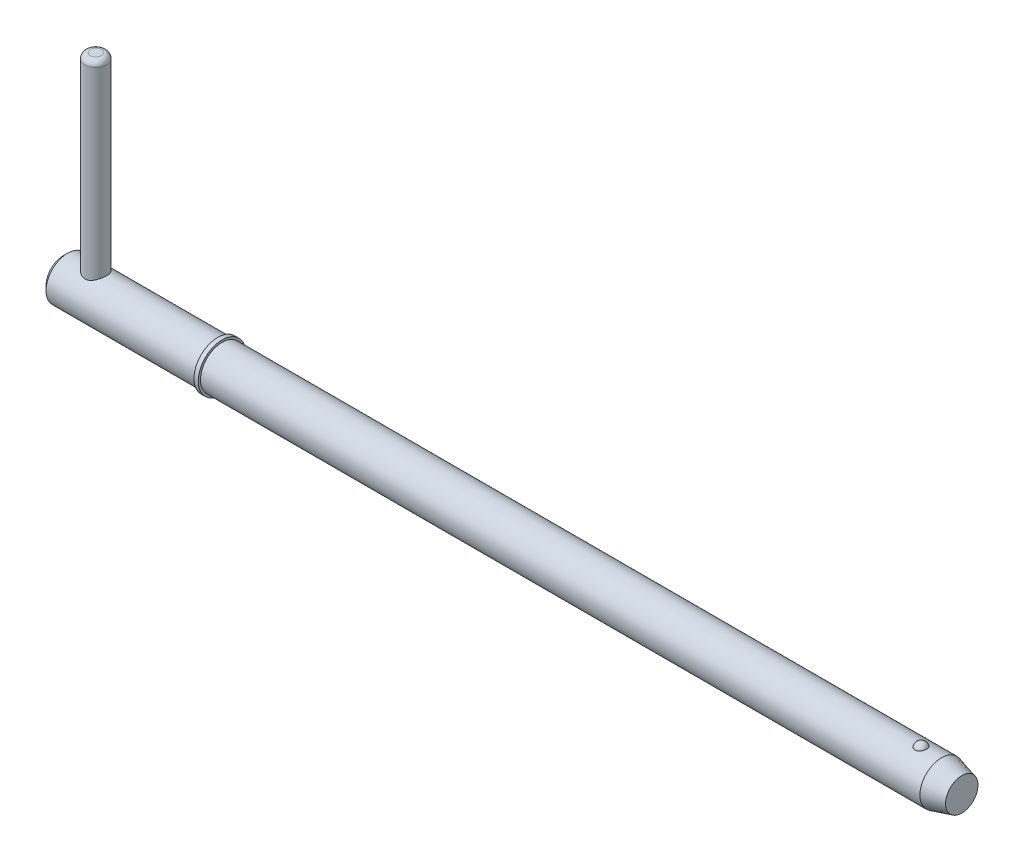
ISO-10303-21;
HEADER;
FILE_DESCRIPTION(('STEP AP214'),'2;1');
FILE_NAME('part.step','',(''),(''),'','','');
FILE_SCHEMA(('AUTOMOTIVE_DESIGN { 1 0 10303 214 1 1 1 1 }'));
ENDSEC;
DATA;
#1=APPLICATION_CONTEXT('core data for automotive mechanical design processes');
#2=APPLICATION_PROTOCOL_DEFINITION('international standard','automotive_design',2000,#1);
#3=PRODUCT_CONTEXT('',#1,'mechanical');
#4=PRODUCT('Part','Part','',(#3));
#5=PRODUCT_RELATED_PRODUCT_CATEGORY('part','',(#4));
#6=PRODUCT_DEFINITION_FORMATION('','',#4);
#7=PRODUCT_DEFINITION_CONTEXT('part definition',#1,'design');
#8=PRODUCT_DEFINITION('design','',#6,#7);
#9=PRODUCT_DEFINITION_SHAPE('','',#8);
#10=(LENGTH_UNIT() NAMED_UNIT(*) SI_UNIT(.MILLI.,.METRE.));
#11=(NAMED_UNIT(*) PLANE_ANGLE_UNIT() SI_UNIT($,.RADIAN.));
#12=(NAMED_UNIT(*) SI_UNIT($,.STERADIAN.) SOLID_ANGLE_UNIT());
#13=UNCERTAINTY_MEASURE_WITH_UNIT(LENGTH_MEASURE(1.E-05),#10,'distance_accuracy_value','');
#14=(GEOMETRIC_REPRESENTATION_CONTEXT(3) GLOBAL_UNCERTAINTY_ASSIGNED_CONTEXT((#13)) GLOBAL_UNIT_ASSIGNED_CONTEXT((#10,
#11,#12)) REPRESENTATION_CONTEXT('',''));
#15=CARTESIAN_POINT('',(0.,0.,0.));
#16=DIRECTION('',(0.,0.,1.));
#17=DIRECTION('',(1.,0.,0.));
#18=AXIS2_PLACEMENT_3D('',#15,#16,#17);
#19=CARTESIAN_POINT('',(3.57,23.02,0.));
#20=DIRECTION('',(0.,-1.,0.));
#21=DIRECTION('',(0.,0.,-1.));
#22=AXIS2_PLACEMENT_3D('',#19,#20,#21);
#23=CYLINDRICAL_SURFACE('',#22,1.19);
#24=CARTESIAN_POINT('',(3.57,-1.785,0.));
#25=DIRECTION('',(0.,1.,0.));
#26=DIRECTION('',(0.,0.,1.));
#27=AXIS2_PLACEMENT_3D('',#24,#25,#26);
#28=CIRCLE('',#27,1.19);
#29=CARTESIAN_POINT('',(3.57,-1.785,1.19));
#30=VERTEX_POINT('',#29);
#31=EDGE_CURVE('P0_E25',#30,#30,#28,.T.);
#32=ORIENTED_EDGE('',*,*,#31,.T.);
#33=EDGE_LOOP('',(#32));
#34=FACE_BOUND('',#33,.T.);
#35=CARTESIAN_POINT('',(3.57,22.425,0.));
#36=DIRECTION('',(0.,1.,0.));
#37=DIRECTION('',(0.,0.,1.));
#38=AXIS2_PLACEMENT_3D('',#35,#36,#37);
#39=CIRCLE('',#38,1.19);
#40=CARTESIAN_POINT('',(3.57,22.425,1.19));
#41=VERTEX_POINT('',#40);
#42=EDGE_CURVE('P0_E29',#41,#41,#39,.F.);
#43=ORIENTED_EDGE('',*,*,#42,.T.);
#44=EDGE_LOOP('',(#43));
#45=FACE_BOUND('',#44,.T.);
#46=ADVANCED_FACE('P0_F14',(#34,#45),#23,.T.);
#47=CARTESIAN_POINT('',(3.57,23.02,0.));
#48=DIRECTION('',(0.,1.,0.));
#49=DIRECTION('',(0.,0.,1.));
#50=AXIS2_PLACEMENT_3D('',#47,#48,#49);
#51=PLANE('',#50);
#52=CARTESIAN_POINT('',(3.57,23.02,0.));
#53=DIRECTION('',(0.,1.,0.));
#54=DIRECTION('',(0.,0.,1.));
#55=AXIS2_PLACEMENT_3D('',#52,#53,#54);
#56=CIRCLE('',#55,0.595);
#57=CARTESIAN_POINT('',(3.57,23.02,0.595));
#58=VERTEX_POINT('',#57);
#59=EDGE_CURVE('P0_E10',#58,#58,#56,.T.);
#60=ORIENTED_EDGE('',*,*,#59,.T.);
#61=EDGE_LOOP('',(#60));
#62=FACE_BOUND('',#61,.T.);
#63=ADVANCED_FACE('P0_F46',(#62),#51,.T.);
#64=CARTESIAN_POINT('',(3.57,-2.38,0.));
#65=DIRECTION('',(0.,1.,0.));
#66=DIRECTION('',(0.,0.,1.));
#67=AXIS2_PLACEMENT_3D('',#64,#65,#66);
#68=PLANE('',#67);
#69=CARTESIAN_POINT('',(3.57,-2.38,0.));
#70=DIRECTION('',(0.,1.,0.));
#71=DIRECTION('',(0.,0.,1.));
#72=AXIS2_PLACEMENT_3D('',#69,#70,#71);
#73=CIRCLE('',#72,0.595);
#74=CARTESIAN_POINT('',(3.57,-2.38,0.595));
#75=VERTEX_POINT('',#74);
#76=EDGE_CURVE('P0_E21',#75,#75,#73,.F.);
#77=ORIENTED_EDGE('',*,*,#76,.T.);
#78=EDGE_LOOP('',(#77));
#79=FACE_BOUND('',#78,.T.);
#80=ADVANCED_FACE('P0_F43',(#79),#68,.F.);
#81=CARTESIAN_POINT('',(3.57,-1.785,0.));
#82=DIRECTION('',(0.,1.,0.));
#83=DIRECTION('',(0.,0.,1.));
#84=AXIS2_PLACEMENT_3D('',#81,#82,#83);
#85=DEGENERATE_TOROIDAL_SURFACE('',#84,0.595,0.595,.T.);
#86=ORIENTED_EDGE('',*,*,#76,.F.);
#87=EDGE_LOOP('',(#86));
#88=FACE_BOUND('',#87,.T.);
#89=ORIENTED_EDGE('',*,*,#31,.F.);
#90=EDGE_LOOP('',(#89));
#91=FACE_BOUND('',#90,.T.);
#92=ADVANCED_FACE('P0_F38',(#88,#91),#85,.T.);
#93=CARTESIAN_POINT('',(3.57,22.425,0.));
#94=DIRECTION('',(0.,1.,0.));
#95=DIRECTION('',(0.,0.,1.));
#96=AXIS2_PLACEMENT_3D('',#93,#94,#95);
#97=DEGENERATE_TOROIDAL_SURFACE('',#96,0.595,0.595,.T.);
#98=ORIENTED_EDGE('',*,*,#42,.F.);
#99=EDGE_LOOP('',(#98));
#100=FACE_BOUND('',#99,.T.);
#101=ORIENTED_EDGE('',*,*,#59,.F.);
#102=EDGE_LOOP('',(#101));
#103=FACE_BOUND('',#102,.T.);
#104=ADVANCED_FACE('P0_F16',(#100,#103),#97,.T.);
#105=CLOSED_SHELL('',(#46,#63,#80,#92,#104));
#106=MANIFOLD_SOLID_BREP('P0_B1',#105);
#107=CARTESIAN_POINT('',(0.,0.,0.));
#108=DIRECTION('',(1.,0.,0.));
#109=DIRECTION('',(0.,0.,-1.));
#110=AXIS2_PLACEMENT_3D('',#107,#108,#109);
#111=CYLINDRICAL_SURFACE('',#110,2.38);
#112=CARTESIAN_POINT('',(96.5094297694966,0.,0.));
#113=DIRECTION('',(1.,0.,0.));
#114=DIRECTION('',(0.,0.,-1.));
#115=AXIS2_PLACEMENT_3D('',#112,#113,#114);
#116=CIRCLE('',#115,2.38);
#117=CARTESIAN_POINT('',(96.5094297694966,0.,-2.38));
#118=VERTEX_POINT('',#117);
#119=EDGE_CURVE('P1_E81',#118,#118,#116,.T.);
#120=ORIENTED_EDGE('',*,*,#119,.F.);
#121=EDGE_LOOP('',(#120));
#122=FACE_BOUND('',#121,.T.);
#123=CARTESIAN_POINT('',(17.45,0.,0.));
#124=DIRECTION('',(1.,0.,0.));
#125=DIRECTION('',(0.,0.,-1.));
#126=AXIS2_PLACEMENT_3D('',#123,#124,#125);
#127=CIRCLE('',#126,2.38);
#128=CARTESIAN_POINT('',(17.45,0.,-2.38));
#129=VERTEX_POINT('',#128);
#130=EDGE_CURVE('P1_E85',#129,#129,#127,.T.);
#131=ORIENTED_EDGE('',*,*,#130,.T.);
#132=EDGE_LOOP('',(#131));
#133=FACE_BOUND('',#132,.T.);
#134=CARTESIAN_POINT('',(94.2634492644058,2.2921568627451,0.640637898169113));
#135=CARTESIAN_POINT('',(94.2303559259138,2.29215737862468,0.64063719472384));
#136=CARTESIAN_POINT('',(94.1972546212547,2.29293179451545,0.637884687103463));
#137=CARTESIAN_POINT('',(94.1320176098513,2.29594030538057,0.626968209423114));
#138=CARTESIAN_POINT('',(94.0998823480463,2.29817506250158,0.618801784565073));
#139=CARTESIAN_POINT('',(94.0375402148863,2.3038430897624,0.597351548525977));
#140=CARTESIAN_POINT('',(94.0073305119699,2.30727454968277,0.584075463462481));
#141=CARTESIAN_POINT('',(93.9495674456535,2.31495941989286,0.552829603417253));
#142=CARTESIAN_POINT('',(93.9220141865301,2.31921286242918,0.534859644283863));
#143=CARTESIAN_POINT('',(93.8695938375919,2.32820213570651,0.494282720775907));
#144=CARTESIAN_POINT('',(93.8448050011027,2.33294694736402,0.471576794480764));
#145=CARTESIAN_POINT('',(93.7992169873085,2.34234144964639,0.422446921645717));
#146=CARTESIAN_POINT('',(93.7784185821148,2.34699112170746,0.396022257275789));
#147=CARTESIAN_POINT('',(93.7403580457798,2.35593942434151,0.338855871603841));
#148=CARTESIAN_POINT('',(93.7233051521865,2.36021170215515,0.307970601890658));
#149=CARTESIAN_POINT('',(93.6943607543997,2.3677057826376,0.243750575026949));
#150=CARTESIAN_POINT('',(93.6824701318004,2.37092740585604,0.210415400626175));
#151=CARTESIAN_POINT('',(93.6638076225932,2.37606901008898,0.141189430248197));
#152=CARTESIAN_POINT('',(93.6571956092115,2.37794816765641,0.105252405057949));
#153=CARTESIAN_POINT('',(93.6498095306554,2.38005135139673,0.032735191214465));
#154=CARTESIAN_POINT('',(93.6490358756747,2.38027526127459,-0.00384504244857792));
#155=CARTESIAN_POINT('',(93.6533628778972,2.37903842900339,-0.0769838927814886));
#156=CARTESIAN_POINT('',(93.6585202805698,2.37756141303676,-0.113538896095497));
#157=CARTESIAN_POINT('',(93.6747013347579,2.37305303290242,-0.185229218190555));
#158=CARTESIAN_POINT('',(93.6857251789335,2.37002161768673,-0.220364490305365));
#159=CARTESIAN_POINT('',(93.7133977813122,2.36273722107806,-0.288156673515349));
#160=CARTESIAN_POINT('',(93.7300389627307,2.35848588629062,-0.320816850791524));
#161=CARTESIAN_POINT('',(93.7685984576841,2.34923130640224,-0.382744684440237));
#162=CARTESIAN_POINT('',(93.790516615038,2.34422808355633,-0.412012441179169));
#163=CARTESIAN_POINT('',(93.8387549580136,2.33412555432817,-0.465830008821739));
#164=CARTESIAN_POINT('',(93.8650028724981,2.32902887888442,-0.490444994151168));
#165=CARTESIAN_POINT('',(93.9214769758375,2.31926941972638,-0.534700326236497));
#166=CARTESIAN_POINT('',(93.9517022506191,2.3146065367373,-0.554341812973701));
#167=CARTESIAN_POINT('',(94.0140618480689,2.30645675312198,-0.587312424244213));
#168=CARTESIAN_POINT('',(94.0460780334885,2.30293152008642,-0.600855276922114));
#169=CARTESIAN_POINT('',(94.1120795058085,2.29725171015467,-0.622220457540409));
#170=CARTESIAN_POINT('',(94.1460641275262,2.29509667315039,-0.630044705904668));
#171=CARTESIAN_POINT('',(94.213299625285,2.29249264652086,-0.639452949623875));
#172=CARTESIAN_POINT('',(94.2465087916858,2.29196755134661,-0.641315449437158));
#173=CARTESIAN_POINT('',(94.312763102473,2.29246849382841,-0.63952261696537));
#174=CARTESIAN_POINT('',(94.3458082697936,2.29349430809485,-0.635868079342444));
#175=CARTESIAN_POINT('',(94.4101025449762,2.29694059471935,-0.623301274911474));
#176=CARTESIAN_POINT('',(94.4413744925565,2.29933234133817,-0.614497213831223));
#177=CARTESIAN_POINT('',(94.5019952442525,2.30522511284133,-0.592006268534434));
#178=CARTESIAN_POINT('',(94.5313438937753,2.30872622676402,-0.578318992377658));
#179=CARTESIAN_POINT('',(94.5880369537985,2.31655795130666,-0.546112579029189));
#180=CARTESIAN_POINT('',(94.615320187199,2.32090569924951,-0.52749010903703));
#181=CARTESIAN_POINT('',(94.6664904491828,2.3299220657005,-0.486117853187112));
#182=CARTESIAN_POINT('',(94.6903767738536,2.33459075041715,-0.463367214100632));
#183=CARTESIAN_POINT('',(94.7352722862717,2.34399834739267,-0.41322006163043));
#184=CARTESIAN_POINT('',(94.7560972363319,2.34873051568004,-0.38565730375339));
#185=CARTESIAN_POINT('',(94.793056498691,2.35754932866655,-0.327455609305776));
#186=CARTESIAN_POINT('',(94.8091898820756,2.36163584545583,-0.296816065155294));
#187=CARTESIAN_POINT('',(94.8369822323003,2.36889321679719,-0.232047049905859));
#188=CARTESIAN_POINT('',(94.8484450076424,2.37202275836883,-0.197828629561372));
#189=CARTESIAN_POINT('',(94.8657523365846,2.37681926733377,-0.127900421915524));
#190=CARTESIAN_POINT('',(94.8715962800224,2.37848607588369,-0.092190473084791));
#191=CARTESIAN_POINT('',(94.877605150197,2.38020024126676,-0.0196348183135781));
#192=CARTESIAN_POINT('',(94.8776704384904,2.38021918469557,0.0172198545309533));
#193=CARTESIAN_POINT('',(94.8718689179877,2.37856356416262,0.0904219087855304));
#194=CARTESIAN_POINT('',(94.8660018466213,2.37688892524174,0.126769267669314));
#195=CARTESIAN_POINT('',(94.848425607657,2.37201688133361,0.198028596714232));
#196=CARTESIAN_POINT('',(94.8366998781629,2.36881516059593,0.232936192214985));
#197=CARTESIAN_POINT('',(94.8076354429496,2.36123444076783,0.300196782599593));
#198=CARTESIAN_POINT('',(94.7902967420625,2.3568554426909,0.332549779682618));
#199=CARTESIAN_POINT('',(94.7505350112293,2.34744667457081,0.39349541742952));
#200=CARTESIAN_POINT('',(94.7281528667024,2.34242227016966,0.422115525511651));
#201=CARTESIAN_POINT('',(94.6787391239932,2.33227293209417,0.475004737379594));
#202=CARTESIAN_POINT('',(94.6517076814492,2.32714800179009,0.499273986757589));
#203=CARTESIAN_POINT('',(94.5944988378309,2.31755359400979,0.542046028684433));
#204=CARTESIAN_POINT('',(94.5644297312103,2.3130698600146,0.560690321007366));
#205=CARTESIAN_POINT('',(94.5013869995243,2.30514125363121,0.592447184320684));
#206=CARTESIAN_POINT('',(94.4684158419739,2.30169550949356,0.605564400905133));
#207=CARTESIAN_POINT('',(94.4068424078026,2.29677744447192,0.623927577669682));
#208=CARTESIAN_POINT('',(94.3785555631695,2.295058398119,0.630178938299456));
#209=CARTESIAN_POINT('',(94.3213308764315,2.29274795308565,0.638534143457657));
#210=CARTESIAN_POINT('',(94.2923931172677,2.29215641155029,0.640638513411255));
#211=CARTESIAN_POINT('',(94.2634492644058,2.2921568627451,0.640637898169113));
#212=B_SPLINE_CURVE_WITH_KNOTS('',3,(#134,#135,#136,#137,#138,#139,#140,#141,#142,#143,#144,
#145,#146,#147,#148,#149,#150,#151,#152,#153,#154,#155,#156,#157,#158,#159,#160,#161,#162,#163,
#164,#165,#166,#167,#168,#169,#170,#171,#172,#173,#174,#175,#176,#177,#178,#179,#180,#181,#182,
#183,#184,#185,#186,#187,#188,#189,#190,#191,#192,#193,#194,#195,#196,#197,#198,#199,#200,#201,
#202,#203,#204,#205,#206,#207,#208,#209,#210,#211),.UNSPECIFIED.,.T.,.F.,(4,2,2,2,2,2,2,2,2,2,2,
2,2,2,2,2,2,2,2,2,2,2,2,2,2,2,2,2,2,2,2,2,2,2,2,2,2,2,4),(0.,0.0991724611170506,
0.198389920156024,0.297457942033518,0.396529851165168,0.497927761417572,0.59934527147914,
0.70547553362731,0.811623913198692,0.920876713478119,1.03013718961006,1.14045177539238,
1.25076998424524,1.36093998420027,1.47110672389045,1.57959248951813,1.68805336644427,
1.79234266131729,1.89659691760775,1.9959039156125,2.09519661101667,2.19247425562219,
2.2897597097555,2.38926978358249,2.48880044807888,2.59293588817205,2.69709193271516,
2.80525821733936,2.91343624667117,3.0234791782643,3.13352698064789,3.24388765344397,
3.35424823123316,3.46374443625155,3.5732369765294,3.67968690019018,3.78604717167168,
3.87279565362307,3.9595331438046),.UNSPECIFIED.);
#213=CARTESIAN_POINT('',(94.2634492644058,2.2921568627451,0.640637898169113));
#214=VERTEX_POINT('',#213);
#215=EDGE_CURVE('P1_E35',#214,#214,#212,.T.);
#216=ORIENTED_EDGE('',*,*,#215,.T.);
#217=EDGE_LOOP('',(#216));
#218=FACE_BOUND('',#217,.T.);
#219=ADVANCED_FACE('P1_F13',(#122,#133,#218),#111,.T.);
#220=CARTESIAN_POINT('',(0.,0.,0.));
#221=DIRECTION('',(-1.,0.,0.));
#222=DIRECTION('',(0.,0.,1.));
#223=AXIS2_PLACEMENT_3D('',#220,#221,#222);
#224=PLANE('',#223);
#225=CARTESIAN_POINT('',(0.,0.,0.));
#226=DIRECTION('',(1.,0.,0.));
#227=DIRECTION('',(0.,0.,-1.));
#228=AXIS2_PLACEMENT_3D('',#225,#226,#227);
#229=CIRCLE('',#228,1.904);
#230=CARTESIAN_POINT('',(0.,0.,-1.904));
#231=VERTEX_POINT('',#230);
#232=EDGE_CURVE('P1_E9',#231,#231,#229,.T.);
#233=ORIENTED_EDGE('',*,*,#232,.F.);
#234=EDGE_LOOP('',(#233));
#235=FACE_BOUND('',#234,.T.);
#236=ADVANCED_FACE('P1_F15',(#235),#224,.T.);
#237=CARTESIAN_POINT('',(0.475999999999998,0.,0.));
#238=DIRECTION('',(1.,0.,0.));
#239=DIRECTION('',(0.,0.,-1.));
#240=AXIS2_PLACEMENT_3D('',#237,#238,#239);
#241=CONICAL_SURFACE('',#240,2.38,0.78539816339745);
#242=ORIENTED_EDGE('',*,*,#232,.T.);
#243=EDGE_LOOP('',(#242));
#244=FACE_BOUND('',#243,.T.);
#245=CARTESIAN_POINT('',(0.475999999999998,0.,0.));
#246=DIRECTION('',(1.,0.,0.));
#247=DIRECTION('',(0.,0.,-1.));
#248=AXIS2_PLACEMENT_3D('',#245,#246,#247);
#249=CIRCLE('',#248,2.38);
#250=CARTESIAN_POINT('',(0.475999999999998,0.,-2.38));
#251=VERTEX_POINT('',#250);
#252=EDGE_CURVE('P1_E26',#251,#251,#249,.T.);
#253=ORIENTED_EDGE('',*,*,#252,.F.);
#254=EDGE_LOOP('',(#253));
#255=FACE_BOUND('',#254,.T.);
#256=ADVANCED_FACE('P1_F77',(#244,#255),#241,.T.);
#257=CARTESIAN_POINT('',(0.,0.,0.));
#258=DIRECTION('',(1.,0.,0.));
#259=DIRECTION('',(0.,0.,-1.));
#260=AXIS2_PLACEMENT_3D('',#257,#258,#259);
#261=CYLINDRICAL_SURFACE('',#260,2.38);
#262=CARTESIAN_POINT('',(3.57,-2.06114046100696,1.19));
#263=CARTESIAN_POINT('',(3.50799170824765,-2.06114586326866,1.18999567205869));
#264=CARTESIAN_POINT('',(3.4459051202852,-2.0639812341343,1.18512096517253));
#265=CARTESIAN_POINT('',(3.32363755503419,-2.07491216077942,1.16587061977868));
#266=CARTESIAN_POINT('',(3.26346086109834,-2.08301876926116,1.15147501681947));
#267=CARTESIAN_POINT('',(3.14701251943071,-2.10331722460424,1.11395893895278));
#268=CARTESIAN_POINT('',(3.09072196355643,-2.1154873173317,1.09088484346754));
#269=CARTESIAN_POINT('',(2.9828251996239,-2.14250771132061,1.03680835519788));
#270=CARTESIAN_POINT('',(2.93121924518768,-2.15735815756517,1.00580553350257));
#271=CARTESIAN_POINT('',(2.82945618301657,-2.18956274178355,0.933753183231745));
#272=CARTESIAN_POINT('',(2.77976962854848,-2.20702235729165,0.892085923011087));
#273=CARTESIAN_POINT('',(2.68772401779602,-2.2416265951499,0.801172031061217));
#274=CARTESIAN_POINT('',(2.64536861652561,-2.25877105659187,0.751921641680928));
#275=CARTESIAN_POINT('',(2.56639309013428,-2.29219557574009,0.64318258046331));
#276=CARTESIAN_POINT('',(2.53035201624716,-2.30833946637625,0.583227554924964));
#277=CARTESIAN_POINT('',(2.46908238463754,-2.3365739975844,0.45714686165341));
#278=CARTESIAN_POINT('',(2.44384700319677,-2.34866719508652,0.391025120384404));
#279=CARTESIAN_POINT('',(2.40676945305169,-2.36667748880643,0.259473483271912));
#280=CARTESIAN_POINT('',(2.39410206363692,-2.37297281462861,0.194329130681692));
#281=CARTESIAN_POINT('',(2.3798023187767,-2.3800902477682,0.0625590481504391));
#282=CARTESIAN_POINT('',(2.37816328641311,-2.38091566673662,-0.00406576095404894));
#283=CARTESIAN_POINT('',(2.38564854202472,-2.37717948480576,-0.130700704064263));
#284=CARTESIAN_POINT('',(2.39384923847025,-2.37308010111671,-0.190782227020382));
#285=CARTESIAN_POINT('',(2.41912820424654,-2.360653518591,-0.308583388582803));
#286=CARTESIAN_POINT('',(2.43620713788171,-2.35232600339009,-0.366302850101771));
#287=CARTESIAN_POINT('',(2.47886825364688,-2.33206184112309,-0.478748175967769));
#288=CARTESIAN_POINT('',(2.50456481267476,-2.32007685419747,-0.533421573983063));
#289=CARTESIAN_POINT('',(2.56357346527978,-2.29357798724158,-0.637812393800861));
#290=CARTESIAN_POINT('',(2.5968882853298,-2.27906320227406,-0.687528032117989));
#291=CARTESIAN_POINT('',(2.67380546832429,-2.24724829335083,-0.785606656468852));
#292=CARTESIAN_POINT('',(2.71808260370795,-2.22981457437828,-0.833397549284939));
#293=CARTESIAN_POINT('',(2.81386177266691,-2.19500665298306,-0.921184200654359));
#294=CARTESIAN_POINT('',(2.86536931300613,-2.17763250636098,-0.961173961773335));
#295=CARTESIAN_POINT('',(2.97815134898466,-2.14371545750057,-1.03471134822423));
#296=CARTESIAN_POINT('',(3.03983836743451,-2.12729540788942,-1.06768860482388));
#297=CARTESIAN_POINT('',(3.16889582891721,-2.09886785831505,-1.12254974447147));
#298=CARTESIAN_POINT('',(3.2362602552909,-2.0868557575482,-1.14444520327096));
#299=CARTESIAN_POINT('',(3.36914526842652,-2.06994116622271,-1.1747444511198));
#300=CARTESIAN_POINT('',(3.43438893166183,-2.06455070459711,-1.18407989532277));
#301=CARTESIAN_POINT('',(3.56571759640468,-2.06010324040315,-1.1918051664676));
#302=CARTESIAN_POINT('',(3.63180197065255,-2.06104176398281,-1.19020272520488));
#303=CARTESIAN_POINT('',(3.75522816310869,-2.06862860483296,-1.17695289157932));
#304=CARTESIAN_POINT('',(3.81273554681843,-2.07464109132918,-1.16642350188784));
#305=CARTESIAN_POINT('',(3.92505766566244,-2.09075885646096,-1.1372785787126));
#306=CARTESIAN_POINT('',(3.97987152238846,-2.1008654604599,-1.1186604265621));
#307=CARTESIAN_POINT('',(4.08813948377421,-2.12458104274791,-1.07296063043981));
#308=CARTESIAN_POINT('',(4.14141303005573,-2.13833055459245,-1.04552693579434));
#309=CARTESIAN_POINT('',(4.2429084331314,-2.16765782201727,-0.983281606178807));
#310=CARTESIAN_POINT('',(4.29112767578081,-2.18323651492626,-0.948466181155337));
#311=CARTESIAN_POINT('',(4.38750473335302,-2.2168271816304,-0.867316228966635));
#312=CARTESIAN_POINT('',(4.43488860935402,-2.23489833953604,-0.82008287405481));
#313=CARTESIAN_POINT('',(4.52130056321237,-2.26973739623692,-0.718051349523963));
#314=CARTESIAN_POINT('',(4.56032581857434,-2.28650485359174,-0.663250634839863));
#315=CARTESIAN_POINT('',(4.62978273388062,-2.31742220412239,-0.545657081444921));
#316=CARTESIAN_POINT('',(4.65996041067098,-2.33149133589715,-0.482691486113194));
#317=CARTESIAN_POINT('',(4.7089941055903,-2.35481192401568,-0.351671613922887));
#318=CARTESIAN_POINT('',(4.7278600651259,-2.36406760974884,-0.283621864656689));
#319=CARTESIAN_POINT('',(4.75210859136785,-2.3760433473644,-0.151105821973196));
#320=CARTESIAN_POINT('',(4.75856947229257,-2.37928514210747,-0.0868836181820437));
#321=CARTESIAN_POINT('',(4.76100348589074,-2.38050135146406,0.0417999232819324));
#322=CARTESIAN_POINT('',(4.75698028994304,-2.37847760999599,0.106261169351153));
#323=CARTESIAN_POINT('',(4.73927447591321,-2.36969422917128,0.229120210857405));
#324=CARTESIAN_POINT('',(4.72624582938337,-2.36325544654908,0.287637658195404));
#325=CARTESIAN_POINT('',(4.69178087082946,-2.34658591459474,0.401560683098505));
#326=CARTESIAN_POINT('',(4.67034335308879,-2.33635462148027,0.456965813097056));
#327=CARTESIAN_POINT('',(4.61871480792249,-2.31247857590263,0.565753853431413));
#328=CARTESIAN_POINT('',(4.58818860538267,-2.29870654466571,0.618948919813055));
#329=CARTESIAN_POINT('',(4.51967006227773,-2.26918878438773,0.719681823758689));
#330=CARTESIAN_POINT('',(4.48167429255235,-2.25344215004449,0.76721704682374));
#331=CARTESIAN_POINT('',(4.39491140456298,-2.21969046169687,0.860267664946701));
#332=CARTESIAN_POINT('',(4.34544863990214,-2.20161660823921,0.905111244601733));
#333=CARTESIAN_POINT('',(4.23943364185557,-2.16655060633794,0.986109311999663));
#334=CARTESIAN_POINT('',(4.18287520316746,-2.1495594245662,1.02225611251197));
#335=CARTESIAN_POINT('',(4.06190239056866,-2.1181953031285,1.08579298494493));
#336=CARTESIAN_POINT('',(3.9972962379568,-2.10392207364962,1.11287022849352));
#337=CARTESIAN_POINT('',(3.86353443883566,-2.08090726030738,1.15534566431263));
#338=CARTESIAN_POINT('',(3.7943948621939,-2.07214719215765,1.17078291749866));
#339=CARTESIAN_POINT('',(3.69875162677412,-2.06499834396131,1.18329673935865));
#340=CARTESIAN_POINT('',(3.67309220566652,-2.06355673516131,1.18580656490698));
#341=CARTESIAN_POINT('',(3.62162638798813,-2.06162663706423,1.18915915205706));
#342=CARTESIAN_POINT('',(3.59581998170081,-2.0611382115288,1.19000180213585));
#343=CARTESIAN_POINT('',(3.57,-2.06114046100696,1.19));
#344=B_SPLINE_CURVE_WITH_KNOTS('',3,(#262,#263,#264,#265,#266,#267,#268,#269,#270,#271,#272,
#273,#274,#275,#276,#277,#278,#279,#280,#281,#282,#283,#284,#285,#286,#287,#288,#289,#290,#291,
#292,#293,#294,#295,#296,#297,#298,#299,#300,#301,#302,#303,#304,#305,#306,#307,#308,#309,#310,
#311,#312,#313,#314,#315,#316,#317,#318,#319,#320,#321,#322,#323,#324,#325,#326,#327,#328,#329,
#330,#331,#332,#333,#334,#335,#336,#337,#338,#339,#340,#341,#342,#343),.UNSPECIFIED.,.T.,.F.,(4,
2,2,2,2,2,2,2,2,2,2,2,2,2,2,2,2,2,2,2,2,2,2,2,2,2,2,2,2,2,2,2,2,2,2,2,2,2,2,2,4),(0.,
0.185916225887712,0.372223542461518,0.557549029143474,0.742884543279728,0.943506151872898,
1.14422749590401,1.35847891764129,1.5725948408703,1.77147547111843,1.97023568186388,
2.15171156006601,2.33320101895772,2.51720146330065,2.70126786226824,2.902733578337,
3.10435357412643,3.31877721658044,3.53297641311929,3.73020126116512,3.92728670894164,
4.1028127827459,4.27839572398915,4.46211082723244,4.64592048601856,4.8529002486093,
5.0599497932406,5.27246375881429,5.48479067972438,5.67763601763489,5.87041383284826,
6.05048865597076,6.23058930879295,6.41839293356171,6.60628297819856,6.8128718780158,
7.01964271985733,7.2329479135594,7.44553408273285,7.52294360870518,7.60035831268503),.UNSPECIFIED.);
#345=CARTESIAN_POINT('',(3.57,-2.06114046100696,1.19));
#346=VERTEX_POINT('',#345);
#347=EDGE_CURVE('P1_E17',#346,#346,#344,.T.);
#348=ORIENTED_EDGE('',*,*,#347,.F.);
#349=EDGE_LOOP('',(#348));
#350=FACE_BOUND('',#349,.T.);
#351=CARTESIAN_POINT('',(3.57,2.06114046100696,1.19));
#352=CARTESIAN_POINT('',(3.63200829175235,2.06114586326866,1.18999567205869));
#353=CARTESIAN_POINT('',(3.6940948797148,2.0639812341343,1.18512096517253));
#354=CARTESIAN_POINT('',(3.81636244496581,2.07491216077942,1.16587061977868));
#355=CARTESIAN_POINT('',(3.87653913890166,2.08301876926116,1.15147501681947));
#356=CARTESIAN_POINT('',(3.99298748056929,2.10331722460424,1.11395893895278));
#357=CARTESIAN_POINT('',(4.04927803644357,2.1154873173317,1.09088484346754));
#358=CARTESIAN_POINT('',(4.1571748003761,2.14250771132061,1.03680835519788));
#359=CARTESIAN_POINT('',(4.20878075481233,2.15735815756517,1.00580553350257));
#360=CARTESIAN_POINT('',(4.31054381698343,2.18956274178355,0.933753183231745));
#361=CARTESIAN_POINT('',(4.36023037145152,2.20702235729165,0.892085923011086));
#362=CARTESIAN_POINT('',(4.45227598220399,2.2416265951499,0.801172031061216));
#363=CARTESIAN_POINT('',(4.49463138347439,2.25877105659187,0.751921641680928));
#364=CARTESIAN_POINT('',(4.57360690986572,2.29219557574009,0.643182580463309));
#365=CARTESIAN_POINT('',(4.60964798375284,2.30833946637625,0.583227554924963));
#366=CARTESIAN_POINT('',(4.67091761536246,2.3365739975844,0.457146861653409));
#367=CARTESIAN_POINT('',(4.69615299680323,2.34866719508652,0.391025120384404));
#368=CARTESIAN_POINT('',(4.73323054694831,2.36667748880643,0.259473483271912));
#369=CARTESIAN_POINT('',(4.74589793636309,2.37297281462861,0.194329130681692));
#370=CARTESIAN_POINT('',(4.7601976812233,2.3800902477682,0.0625590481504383));
#371=CARTESIAN_POINT('',(4.76183671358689,2.38091566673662,-0.00406576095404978));
#372=CARTESIAN_POINT('',(4.75435145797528,2.37717948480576,-0.130700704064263));
#373=CARTESIAN_POINT('',(4.74615076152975,2.37308010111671,-0.190782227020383));
#374=CARTESIAN_POINT('',(4.72087179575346,2.360653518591,-0.308583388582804));
#375=CARTESIAN_POINT('',(4.70379286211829,2.35232600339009,-0.366302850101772));
#376=CARTESIAN_POINT('',(4.66113174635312,2.33206184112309,-0.478748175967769));
#377=CARTESIAN_POINT('',(4.63543518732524,2.32007685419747,-0.533421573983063));
#378=CARTESIAN_POINT('',(4.57642653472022,2.29357798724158,-0.637812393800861));
#379=CARTESIAN_POINT('',(4.5431117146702,2.27906320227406,-0.687528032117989));
#380=CARTESIAN_POINT('',(4.46619453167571,2.24724829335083,-0.785606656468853));
#381=CARTESIAN_POINT('',(4.42191739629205,2.22981457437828,-0.83339754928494));
#382=CARTESIAN_POINT('',(4.32613822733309,2.19500665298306,-0.921184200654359));
#383=CARTESIAN_POINT('',(4.27463068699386,2.17763250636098,-0.961173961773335));
#384=CARTESIAN_POINT('',(4.16184865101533,2.14371545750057,-1.03471134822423));
#385=CARTESIAN_POINT('',(4.10016163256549,2.12729540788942,-1.06768860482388));
#386=CARTESIAN_POINT('',(3.97110417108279,2.09886785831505,-1.12254974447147));
#387=CARTESIAN_POINT('',(3.9037397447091,2.0868557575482,-1.14444520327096));
#388=CARTESIAN_POINT('',(3.77085473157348,2.06994116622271,-1.1747444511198));
#389=CARTESIAN_POINT('',(3.70561106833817,2.06455070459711,-1.18407989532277));
#390=CARTESIAN_POINT('',(3.57428240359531,2.06010324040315,-1.1918051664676));
#391=CARTESIAN_POINT('',(3.50819802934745,2.06104176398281,-1.19020272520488));
#392=CARTESIAN_POINT('',(3.38477183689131,2.06862860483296,-1.17695289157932));
#393=CARTESIAN_POINT('',(3.32726445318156,2.07464109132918,-1.16642350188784));
#394=CARTESIAN_POINT('',(3.21494233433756,2.09075885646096,-1.1372785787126));
#395=CARTESIAN_POINT('',(3.16012847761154,2.1008654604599,-1.1186604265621));
#396=CARTESIAN_POINT('',(3.05186051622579,2.12458104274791,-1.07296063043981));
#397=CARTESIAN_POINT('',(2.99858696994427,2.13833055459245,-1.04552693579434));
#398=CARTESIAN_POINT('',(2.8970915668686,2.16765782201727,-0.983281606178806));
#399=CARTESIAN_POINT('',(2.84887232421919,2.18323651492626,-0.948466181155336));
#400=CARTESIAN_POINT('',(2.75249526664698,2.2168271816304,-0.867316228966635));
#401=CARTESIAN_POINT('',(2.70511139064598,2.23489833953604,-0.820082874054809));
#402=CARTESIAN_POINT('',(2.61869943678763,2.26973739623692,-0.718051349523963));
#403=CARTESIAN_POINT('',(2.57967418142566,2.28650485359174,-0.663250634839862));
#404=CARTESIAN_POINT('',(2.51021726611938,2.31742220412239,-0.54565708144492));
#405=CARTESIAN_POINT('',(2.48003958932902,2.33149133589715,-0.482691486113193));
#406=CARTESIAN_POINT('',(2.4310058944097,2.35481192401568,-0.351671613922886));
#407=CARTESIAN_POINT('',(2.4121399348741,2.36406760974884,-0.283621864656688));
#408=CARTESIAN_POINT('',(2.38789140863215,2.3760433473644,-0.151105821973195));
#409=CARTESIAN_POINT('',(2.38143052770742,2.37928514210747,-0.0868836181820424));
#410=CARTESIAN_POINT('',(2.37899651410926,2.38050135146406,0.0417999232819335));
#411=CARTESIAN_POINT('',(2.38301971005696,2.37847760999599,0.106261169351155));
#412=CARTESIAN_POINT('',(2.40072552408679,2.36969422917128,0.229120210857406));
#413=CARTESIAN_POINT('',(2.41375417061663,2.36325544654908,0.287637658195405));
#414=CARTESIAN_POINT('',(2.44821912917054,2.34658591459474,0.401560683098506));
#415=CARTESIAN_POINT('',(2.46965664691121,2.33635462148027,0.456965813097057));
#416=CARTESIAN_POINT('',(2.52128519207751,2.31247857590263,0.565753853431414));
#417=CARTESIAN_POINT('',(2.55181139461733,2.29870654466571,0.618948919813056));
#418=CARTESIAN_POINT('',(2.62032993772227,2.26918878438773,0.719681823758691));
#419=CARTESIAN_POINT('',(2.65832570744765,2.25344215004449,0.767217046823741));
#420=CARTESIAN_POINT('',(2.74508859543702,2.21969046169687,0.860267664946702));
#421=CARTESIAN_POINT('',(2.79455136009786,2.20161660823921,0.905111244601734));
#422=CARTESIAN_POINT('',(2.90056635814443,2.16655060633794,0.986109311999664));
#423=CARTESIAN_POINT('',(2.95712479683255,2.1495594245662,1.02225611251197));
#424=CARTESIAN_POINT('',(3.07809760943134,2.1181953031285,1.08579298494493));
#425=CARTESIAN_POINT('',(3.1427037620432,2.10392207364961,1.11287022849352));
#426=CARTESIAN_POINT('',(3.27646556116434,2.08090726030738,1.15534566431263));
#427=CARTESIAN_POINT('',(3.3456051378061,2.07214719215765,1.17078291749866));
#428=CARTESIAN_POINT('',(3.44124837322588,2.06499834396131,1.18329673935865));
#429=CARTESIAN_POINT('',(3.46690779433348,2.06355673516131,1.18580656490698));
#430=CARTESIAN_POINT('',(3.51837361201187,2.06162663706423,1.18915915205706));
#431=CARTESIAN_POINT('',(3.54418001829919,2.0611382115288,1.19000180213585));
#432=CARTESIAN_POINT('',(3.57,2.06114046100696,1.19));
#433=B_SPLINE_CURVE_WITH_KNOTS('',3,(#351,#352,#353,#354,#355,#356,#357,#358,#359,#360,#361,
#362,#363,#364,#365,#366,#367,#368,#369,#370,#371,#372,#373,#374,#375,#376,#377,#378,#379,#380,
#381,#382,#383,#384,#385,#386,#387,#388,#389,#390,#391,#392,#393,#394,#395,#396,#397,#398,#399,
#400,#401,#402,#403,#404,#405,#406,#407,#408,#409,#410,#411,#412,#413,#414,#415,#416,#417,#418,
#419,#420,#421,#422,#423,#424,#425,#426,#427,#428,#429,#430,#431,#432),.UNSPECIFIED.,.T.,.F.,(4,
2,2,2,2,2,2,2,2,2,2,2,2,2,2,2,2,2,2,2,2,2,2,2,2,2,2,2,2,2,2,2,2,2,2,2,2,2,2,2,4),(0.,
0.185916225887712,0.372223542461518,0.557549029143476,0.74288454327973,0.9435061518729,
1.14422749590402,1.35847891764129,1.5725948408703,1.77147547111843,1.97023568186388,
2.15171156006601,2.33320101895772,2.51720146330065,2.70126786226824,2.902733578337,
3.10435357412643,3.31877721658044,3.53297641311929,3.73020126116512,3.92728670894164,
4.1028127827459,4.27839572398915,4.46211082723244,4.64592048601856,4.8529002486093,
5.05994979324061,5.27246375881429,5.48479067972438,5.67763601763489,5.87041383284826,
6.05048865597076,6.23058930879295,6.41839293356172,6.60628297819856,6.8128718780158,
7.01964271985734,7.2329479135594,7.44553408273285,7.52294360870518,7.60035831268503),.UNSPECIFIED.);
#434=CARTESIAN_POINT('',(3.57,2.06114046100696,1.19));
#435=VERTEX_POINT('',#434);
#436=EDGE_CURVE('P1_E43',#435,#435,#433,.T.);
#437=ORIENTED_EDGE('',*,*,#436,.F.);
#438=EDGE_LOOP('',(#437));
#439=FACE_BOUND('',#438,.T.);
#440=ORIENTED_EDGE('',*,*,#252,.T.);
#441=EDGE_LOOP('',(#440));
#442=FACE_BOUND('',#441,.T.);
#443=CARTESIAN_POINT('',(16.974,0.,0.));
#444=DIRECTION('',(1.,0.,0.));
#445=DIRECTION('',(0.,0.,-1.));
#446=AXIS2_PLACEMENT_3D('',#443,#444,#445);
#447=CIRCLE('',#446,2.38);
#448=CARTESIAN_POINT('',(16.974,0.,-2.38));
#449=VERTEX_POINT('',#448);
#450=EDGE_CURVE('P1_E31',#449,#449,#447,.T.);
#451=ORIENTED_EDGE('',*,*,#450,.F.);
#452=EDGE_LOOP('',(#451));
#453=FACE_BOUND('',#452,.T.);
#454=ADVANCED_FACE('P1_F103',(#350,#439,#442,#453),#261,.T.);
#455=CARTESIAN_POINT('',(16.974,2.38,0.));
#456=DIRECTION('',(-1.,0.,0.));
#457=DIRECTION('',(0.,0.,1.));
#458=AXIS2_PLACEMENT_3D('',#455,#456,#457);
#459=PLANE('',#458);
#460=ORIENTED_EDGE('',*,*,#450,.T.);
#461=EDGE_LOOP('',(#460));
#462=FACE_BOUND('',#461,.T.);
#463=CARTESIAN_POINT('',(16.974,0.,0.));
#464=DIRECTION('',(1.,0.,0.));
#465=DIRECTION('',(0.,0.,-1.));
#466=AXIS2_PLACEMENT_3D('',#463,#464,#465);
#467=CIRCLE('',#466,2.618);
#468=CARTESIAN_POINT('',(16.974,0.,-2.618));
#469=VERTEX_POINT('',#468);
#470=EDGE_CURVE('P1_E91',#469,#469,#467,.T.);
#471=ORIENTED_EDGE('',*,*,#470,.F.);
#472=EDGE_LOOP('',(#471));
#473=FACE_BOUND('',#472,.T.);
#474=ADVANCED_FACE('P1_F100',(#462,#473),#459,.T.);
#475=CARTESIAN_POINT('',(0.,0.,0.));
#476=DIRECTION('',(1.,0.,0.));
#477=DIRECTION('',(0.,0.,-1.));
#478=AXIS2_PLACEMENT_3D('',#475,#476,#477);
#479=CYLINDRICAL_SURFACE('',#478,2.618);
#480=ORIENTED_EDGE('',*,*,#470,.T.);
#481=EDGE_LOOP('',(#480));
#482=FACE_BOUND('',#481,.T.);
#483=CARTESIAN_POINT('',(17.45,0.,0.));
#484=DIRECTION('',(1.,0.,0.));
#485=DIRECTION('',(0.,0.,-1.));
#486=AXIS2_PLACEMENT_3D('',#483,#484,#485);
#487=CIRCLE('',#486,2.618);
#488=CARTESIAN_POINT('',(17.45,0.,-2.618));
#489=VERTEX_POINT('',#488);
#490=EDGE_CURVE('P1_E88',#489,#489,#487,.T.);
#491=ORIENTED_EDGE('',*,*,#490,.F.);
#492=EDGE_LOOP('',(#491));
#493=FACE_BOUND('',#492,.T.);
#494=ADVANCED_FACE('P1_F68',(#482,#493),#479,.T.);
#495=CARTESIAN_POINT('',(17.45,2.618,0.));
#496=DIRECTION('',(1.,0.,0.));
#497=DIRECTION('',(0.,0.,-1.));
#498=AXIS2_PLACEMENT_3D('',#495,#496,#497);
#499=PLANE('',#498);
#500=ORIENTED_EDGE('',*,*,#490,.T.);
#501=EDGE_LOOP('',(#500));
#502=FACE_BOUND('',#501,.T.);
#503=ORIENTED_EDGE('',*,*,#130,.F.);
#504=EDGE_LOOP('',(#503));
#505=FACE_BOUND('',#504,.T.);
#506=ADVANCED_FACE('P1_F62',(#502,#505),#499,.T.);
#507=CARTESIAN_POINT('',(98.73,0.,0.));
#508=DIRECTION('',(-1.,0.,0.));
#509=DIRECTION('',(0.,0.,1.));
#510=AXIS2_PLACEMENT_3D('',#507,#508,#509);
#511=CONICAL_SURFACE('',#510,1.78500000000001,0.261799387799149);
#512=ORIENTED_EDGE('',*,*,#119,.T.);
#513=EDGE_LOOP('',(#512));
#514=FACE_BOUND('',#513,.T.);
#515=CARTESIAN_POINT('',(98.73,0.,0.));
#516=DIRECTION('',(1.,0.,0.));
#517=DIRECTION('',(0.,0.,-1.));
#518=AXIS2_PLACEMENT_3D('',#515,#516,#517);
#519=CIRCLE('',#518,1.78500000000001);
#520=CARTESIAN_POINT('',(98.73,0.,-1.78500000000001));
#521=VERTEX_POINT('',#520);
#522=EDGE_CURVE('P1_E42',#521,#521,#519,.T.);
#523=ORIENTED_EDGE('',*,*,#522,.F.);
#524=EDGE_LOOP('',(#523));
#525=FACE_BOUND('',#524,.T.);
#526=ADVANCED_FACE('P1_F59',(#514,#525),#511,.T.);
#527=CARTESIAN_POINT('',(98.73,1.78500000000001,0.));
#528=DIRECTION('',(1.,0.,0.));
#529=DIRECTION('',(0.,0.,-1.));
#530=AXIS2_PLACEMENT_3D('',#527,#528,#529);
#531=PLANE('',#530);
#532=ORIENTED_EDGE('',*,*,#522,.T.);
#533=EDGE_LOOP('',(#532));
#534=FACE_BOUND('',#533,.T.);
#535=ADVANCED_FACE('P1_F55',(#534),#531,.T.);
#536=CARTESIAN_POINT('',(94.2634492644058,2.142,0.));
#537=DIRECTION('',(-1.,0.,0.));
#538=DIRECTION('',(0.,1.,0.));
#539=AXIS2_PLACEMENT_3D('',#536,#537,#538);
#540=SPHERICAL_SURFACE('',#539,0.657999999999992);
#541=ORIENTED_EDGE('',*,*,#215,.F.);
#542=EDGE_LOOP('',(#541));
#543=FACE_BOUND('',#542,.T.);
#544=ADVANCED_FACE('P1_F50',(#543),#540,.T.);
#545=CARTESIAN_POINT('',(3.57,-2.618,0.));
#546=DIRECTION('',(0.,1.,0.));
#547=DIRECTION('',(0.,0.,1.));
#548=AXIS2_PLACEMENT_3D('',#545,#546,#547);
#549=CYLINDRICAL_SURFACE('',#548,1.19);
#550=ORIENTED_EDGE('',*,*,#347,.T.);
#551=EDGE_LOOP('',(#550));
#552=FACE_BOUND('',#551,.T.);
#553=ORIENTED_EDGE('',*,*,#436,.T.);
#554=EDGE_LOOP('',(#553));
#555=FACE_BOUND('',#554,.T.);
#556=ADVANCED_FACE('P1_F54',(#552,#555),#549,.F.);
#557=CLOSED_SHELL('',(#219,#236,#256,#454,#474,#494,#506,#526,#535,#544,#556));
#558=MANIFOLD_SOLID_BREP('P1_B1',#557);
#559=ADVANCED_BREP_SHAPE_REPRESENTATION('',(#18,#106,#558),#14);
#560=SHAPE_DEFINITION_REPRESENTATION(#9,#559);
ENDSEC;
END-ISO-10303-21;
